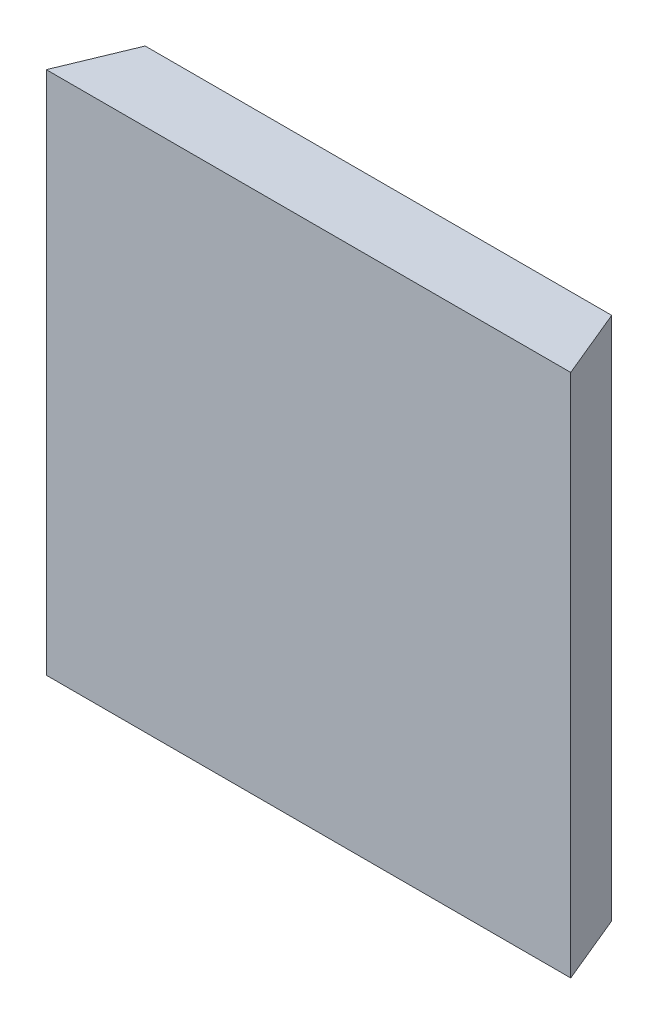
ISO-10303-21;
HEADER;
FILE_DESCRIPTION(('STEP AP214'),'2;1');
FILE_NAME('part.step','',(''),(''),'','','');
FILE_SCHEMA(('AUTOMOTIVE_DESIGN { 1 0 10303 214 1 1 1 1 }'));
ENDSEC;
DATA;
#1=APPLICATION_CONTEXT('core data for automotive mechanical design processes');
#2=APPLICATION_PROTOCOL_DEFINITION('international standard','automotive_design',2000,#1);
#3=PRODUCT_CONTEXT('',#1,'mechanical');
#4=PRODUCT('Part','Part','',(#3));
#5=PRODUCT_RELATED_PRODUCT_CATEGORY('part','',(#4));
#6=PRODUCT_DEFINITION_FORMATION('','',#4);
#7=PRODUCT_DEFINITION_CONTEXT('part definition',#1,'design');
#8=PRODUCT_DEFINITION('design','',#6,#7);
#9=PRODUCT_DEFINITION_SHAPE('','',#8);
#10=(LENGTH_UNIT() NAMED_UNIT(*) SI_UNIT(.MILLI.,.METRE.));
#11=(NAMED_UNIT(*) PLANE_ANGLE_UNIT() SI_UNIT($,.RADIAN.));
#12=(NAMED_UNIT(*) SI_UNIT($,.STERADIAN.) SOLID_ANGLE_UNIT());
#13=UNCERTAINTY_MEASURE_WITH_UNIT(LENGTH_MEASURE(1.E-05),#10,'distance_accuracy_value','');
#14=(GEOMETRIC_REPRESENTATION_CONTEXT(3) GLOBAL_UNCERTAINTY_ASSIGNED_CONTEXT((#13)) GLOBAL_UNIT_ASSIGNED_CONTEXT((#10,
#11,#12)) REPRESENTATION_CONTEXT('',''));
#15=CARTESIAN_POINT('',(0.,0.,0.));
#16=DIRECTION('',(0.,0.,1.));
#17=DIRECTION('',(1.,0.,0.));
#18=AXIS2_PLACEMENT_3D('',#15,#16,#17);
#19=CARTESIAN_POINT('',(-15.,0.,4.));
#20=DIRECTION('',(0.,1.,0.));
#21=DIRECTION('',(-1.,0.,0.));
#22=AXIS2_PLACEMENT_3D('',#19,#20,#21);
#23=PLANE('',#22);
#24=DIRECTION('',(1.,0.,0.));
#25=VECTOR('',#24,1.);
#26=CARTESIAN_POINT('',(-15.,0.,0.));
#27=LINE('',#26,#25);
#28=CARTESIAN_POINT('',(-13.3431457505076,0.,0.));
#29=VERTEX_POINT('',#28);
#30=CARTESIAN_POINT('',(13.3431457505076,0.,0.));
#31=VERTEX_POINT('',#30);
#32=EDGE_CURVE('E92',#29,#31,#27,.T.);
#33=ORIENTED_EDGE('',*,*,#32,.T.);
#34=DIRECTION('',(-0.382683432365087,0.,-0.923879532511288));
#35=VECTOR('',#34,1.);
#36=CARTESIAN_POINT('',(15.,0.,4.00000000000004));
#37=LINE('',#36,#35);
#38=CARTESIAN_POINT('',(15.,0.,4.));
#39=VERTEX_POINT('',#38);
#40=EDGE_CURVE('E11',#31,#39,#37,.F.);
#41=ORIENTED_EDGE('',*,*,#40,.T.);
#42=DIRECTION('',(1.,0.,0.));
#43=VECTOR('',#42,1.);
#44=CARTESIAN_POINT('',(-15.,0.,4.));
#45=LINE('',#44,#43);
#46=CARTESIAN_POINT('',(-15.,0.,4.));
#47=VERTEX_POINT('',#46);
#48=EDGE_CURVE('E78',#47,#39,#45,.T.);
#49=ORIENTED_EDGE('',*,*,#48,.F.);
#50=DIRECTION('',(-0.382683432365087,0.,0.923879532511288));
#51=VECTOR('',#50,1.);
#52=CARTESIAN_POINT('',(-15.,0.,4.00000000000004));
#53=LINE('',#52,#51);
#54=EDGE_CURVE('E41',#47,#29,#53,.F.);
#55=ORIENTED_EDGE('',*,*,#54,.T.);
#56=EDGE_LOOP('',(#33,#41,#49,#55));
#57=FACE_BOUND('',#56,.T.);
#58=ADVANCED_FACE('F33',(#57),#23,.F.);
#59=CARTESIAN_POINT('',(15.,30.,4.));
#60=DIRECTION('',(0.,-1.,0.));
#61=DIRECTION('',(1.,0.,0.));
#62=AXIS2_PLACEMENT_3D('',#59,#60,#61);
#63=PLANE('',#62);
#64=DIRECTION('',(-1.,0.,0.));
#65=VECTOR('',#64,1.);
#66=CARTESIAN_POINT('',(15.,30.,4.));
#67=LINE('',#66,#65);
#68=CARTESIAN_POINT('',(15.,30.,4.));
#69=VERTEX_POINT('',#68);
#70=CARTESIAN_POINT('',(-15.,30.,4.));
#71=VERTEX_POINT('',#70);
#72=EDGE_CURVE('E88',#69,#71,#67,.T.);
#73=ORIENTED_EDGE('',*,*,#72,.F.);
#74=DIRECTION('',(0.382683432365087,0.,0.923879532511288));
#75=VECTOR('',#74,1.);
#76=CARTESIAN_POINT('',(15.,30.,4.00000000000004));
#77=LINE('',#76,#75);
#78=CARTESIAN_POINT('',(13.3431457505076,30.,0.));
#79=VERTEX_POINT('',#78);
#80=EDGE_CURVE('E100',#69,#79,#77,.F.);
#81=ORIENTED_EDGE('',*,*,#80,.T.);
#82=DIRECTION('',(-1.,0.,0.));
#83=VECTOR('',#82,1.);
#84=CARTESIAN_POINT('',(15.,30.,0.));
#85=LINE('',#84,#83);
#86=CARTESIAN_POINT('',(-13.3431457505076,30.,0.));
#87=VERTEX_POINT('',#86);
#88=EDGE_CURVE('E89',#79,#87,#85,.T.);
#89=ORIENTED_EDGE('',*,*,#88,.T.);
#90=DIRECTION('',(0.382683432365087,0.,-0.923879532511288));
#91=VECTOR('',#90,1.);
#92=CARTESIAN_POINT('',(-15.,30.,4.00000000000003));
#93=LINE('',#92,#91);
#94=EDGE_CURVE('E97',#87,#71,#93,.F.);
#95=ORIENTED_EDGE('',*,*,#94,.T.);
#96=EDGE_LOOP('',(#73,#81,#89,#95));
#97=FACE_BOUND('',#96,.T.);
#98=ADVANCED_FACE('F105',(#97),#63,.F.);
#99=CARTESIAN_POINT('',(0.,0.,4.));
#100=DIRECTION('',(0.,0.,1.));
#101=DIRECTION('',(1.,0.,0.));
#102=AXIS2_PLACEMENT_3D('',#99,#100,#101);
#103=PLANE('',#102);
#104=DIRECTION('',(0.,-1.,0.));
#105=VECTOR('',#104,1.);
#106=CARTESIAN_POINT('',(-15.,30.,4.));
#107=LINE('',#106,#105);
#108=EDGE_CURVE('E75',#71,#47,#107,.T.);
#109=ORIENTED_EDGE('',*,*,#108,.T.);
#110=ORIENTED_EDGE('',*,*,#48,.T.);
#111=DIRECTION('',(0.,1.,0.));
#112=VECTOR('',#111,1.);
#113=CARTESIAN_POINT('',(15.,0.,4.));
#114=LINE('',#113,#112);
#115=EDGE_CURVE('E83',#39,#69,#114,.T.);
#116=ORIENTED_EDGE('',*,*,#115,.T.);
#117=ORIENTED_EDGE('',*,*,#72,.T.);
#118=EDGE_LOOP('',(#109,#110,#116,#117));
#119=FACE_BOUND('',#118,.T.);
#120=ADVANCED_FACE('F86',(#119),#103,.T.);
#121=CARTESIAN_POINT('',(0.,0.,0.));
#122=DIRECTION('',(0.,0.,1.));
#123=DIRECTION('',(1.,0.,0.));
#124=AXIS2_PLACEMENT_3D('',#121,#122,#123);
#125=PLANE('',#124);
#126=ORIENTED_EDGE('',*,*,#88,.F.);
#127=DIRECTION('',(0.,-1.,0.));
#128=VECTOR('',#127,1.);
#129=CARTESIAN_POINT('',(13.3431457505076,0.,0.));
#130=LINE('',#129,#128);
#131=EDGE_CURVE('E48',#79,#31,#130,.T.);
#132=ORIENTED_EDGE('',*,*,#131,.T.);
#133=ORIENTED_EDGE('',*,*,#32,.F.);
#134=DIRECTION('',(0.,1.,0.));
#135=VECTOR('',#134,1.);
#136=CARTESIAN_POINT('',(-13.3431457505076,0.,0.));
#137=LINE('',#136,#135);
#138=EDGE_CURVE('E76',#29,#87,#137,.T.);
#139=ORIENTED_EDGE('',*,*,#138,.T.);
#140=EDGE_LOOP('',(#126,#132,#133,#139));
#141=FACE_BOUND('',#140,.T.);
#142=ADVANCED_FACE('F103',(#141),#125,.F.);
#143=CARTESIAN_POINT('',(15.,0.,4.00000000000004));
#144=DIRECTION('',(-0.923879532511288,0.,0.382683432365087));
#145=DIRECTION('',(0.,1.,0.));
#146=AXIS2_PLACEMENT_3D('',#143,#144,#145);
#147=PLANE('',#146);
#148=ORIENTED_EDGE('',*,*,#40,.F.);
#149=ORIENTED_EDGE('',*,*,#131,.F.);
#150=ORIENTED_EDGE('',*,*,#80,.F.);
#151=ORIENTED_EDGE('',*,*,#115,.F.);
#152=EDGE_LOOP('',(#148,#149,#150,#151));
#153=FACE_BOUND('',#152,.T.);
#154=ADVANCED_FACE('F107',(#153),#147,.F.);
#155=CARTESIAN_POINT('',(-15.,30.,4.00000000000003));
#156=DIRECTION('',(0.923879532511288,0.,0.382683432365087));
#157=DIRECTION('',(0.,-1.,0.));
#158=AXIS2_PLACEMENT_3D('',#155,#156,#157);
#159=PLANE('',#158);
#160=ORIENTED_EDGE('',*,*,#94,.F.);
#161=ORIENTED_EDGE('',*,*,#138,.F.);
#162=ORIENTED_EDGE('',*,*,#54,.F.);
#163=ORIENTED_EDGE('',*,*,#108,.F.);
#164=EDGE_LOOP('',(#160,#161,#162,#163));
#165=FACE_BOUND('',#164,.T.);
#166=ADVANCED_FACE('F35',(#165),#159,.F.);
#167=CLOSED_SHELL('',(#58,#98,#120,#142,#154,#166));
#168=MANIFOLD_SOLID_BREP('B2',#167);
#169=ADVANCED_BREP_SHAPE_REPRESENTATION('',(#18,#168),#14);
#170=SHAPE_DEFINITION_REPRESENTATION(#9,#169);
ENDSEC;
END-ISO-10303-21;
